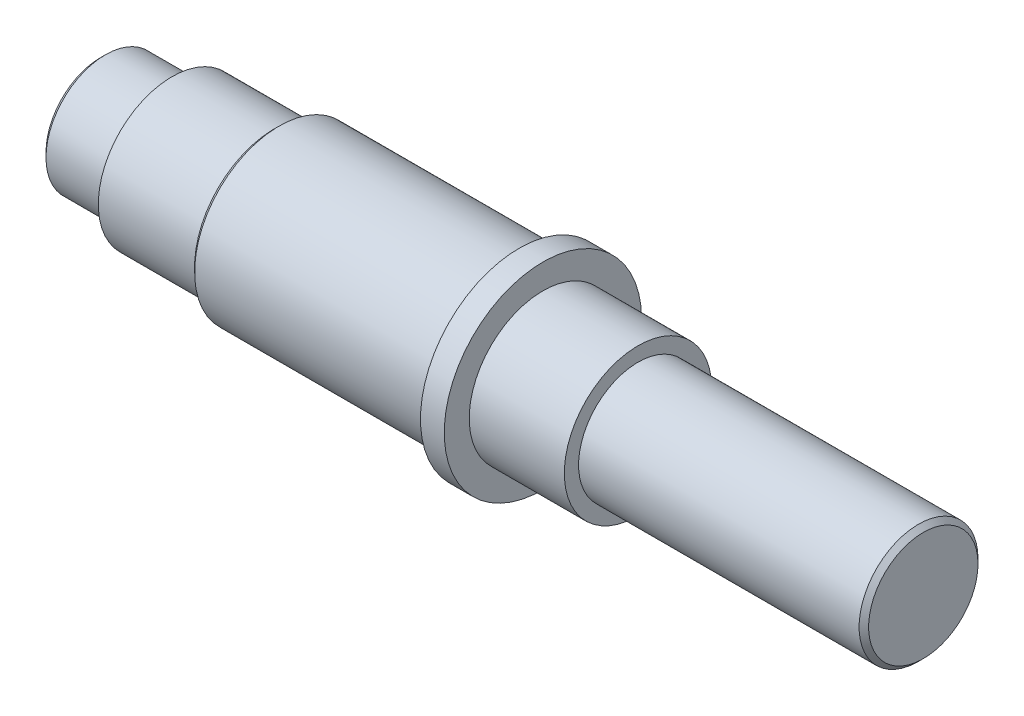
from build123d import *

# Parameters (mm, degrees)
ZKOSEN_1_SIZE = 1


with BuildPart() as part:
    # Skica1 → Rotovat8 (revolve)
    with BuildSketch(Plane.XY, mode=Mode.PRIVATE) as rotovat8_sk:
        Polygon((48.25, 12.5), (48.25, 15.5), (28.25, 15.5), (28.25, 20.75), (23.25, 20.75), (23.25, 17.75), (-28.25, 17.75), (-28.25, 15.5), (-49.75, 15.5), (-49.75, 12.5), (-64.75, 12.5), (-64.75, 0), (108.25, 0), (108.25, 12.5), align=None)
    revolve(rotovat8_sk.sketch.rotate(Axis((200, 0, 0), (-1, 0, 0)), 90), axis=Axis((200, 0, 0), (-1, 0, 0)))

    # Zkosen_1
    zkosen_1_edges = [part.edges().sort_by_distance(p)[0] for p in [
        (-28.25, 0, 17.75),
        (108.25, 0, 12.5),
        (-64.75, 0, 12.5),
    ]]
    chamfer(zkosen_1_edges, length=ZKOSEN_1_SIZE)


solid = part.part
